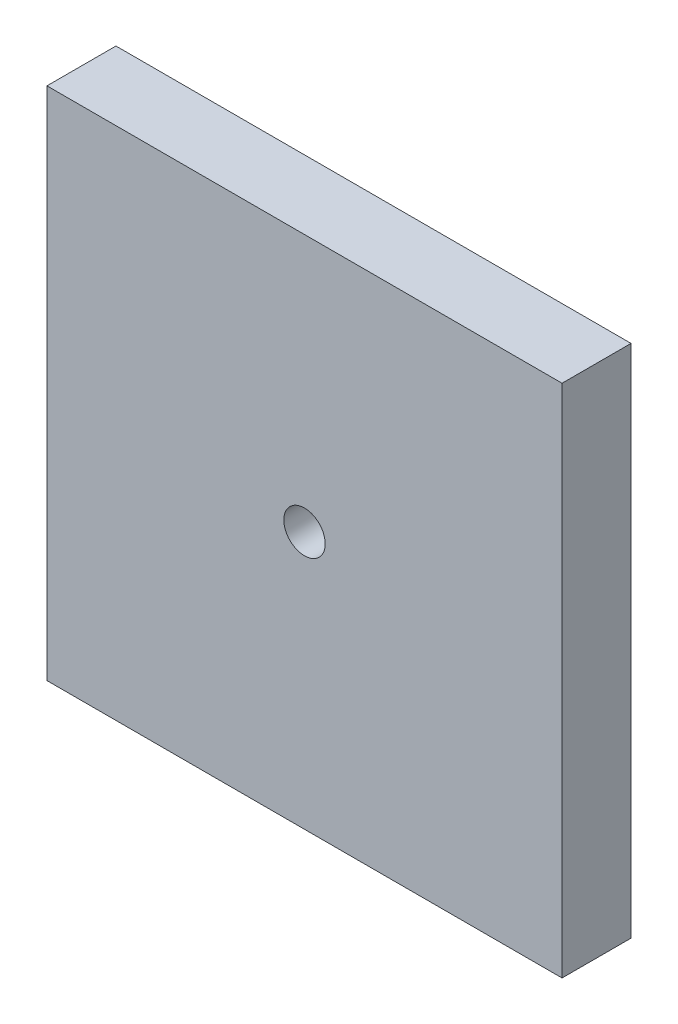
ISO-10303-21;
HEADER;
FILE_DESCRIPTION(('STEP AP214'),'2;1');
FILE_NAME('part.step','',(''),(''),'','','');
FILE_SCHEMA(('AUTOMOTIVE_DESIGN { 1 0 10303 214 1 1 1 1 }'));
ENDSEC;
DATA;
#1=APPLICATION_CONTEXT('core data for automotive mechanical design processes');
#2=APPLICATION_PROTOCOL_DEFINITION('international standard','automotive_design',2000,#1);
#3=PRODUCT_CONTEXT('',#1,'mechanical');
#4=PRODUCT('Part','Part','',(#3));
#5=PRODUCT_RELATED_PRODUCT_CATEGORY('part','',(#4));
#6=PRODUCT_DEFINITION_FORMATION('','',#4);
#7=PRODUCT_DEFINITION_CONTEXT('part definition',#1,'design');
#8=PRODUCT_DEFINITION('design','',#6,#7);
#9=PRODUCT_DEFINITION_SHAPE('','',#8);
#10=(LENGTH_UNIT() NAMED_UNIT(*) SI_UNIT(.MILLI.,.METRE.));
#11=(NAMED_UNIT(*) PLANE_ANGLE_UNIT() SI_UNIT($,.RADIAN.));
#12=(NAMED_UNIT(*) SI_UNIT($,.STERADIAN.) SOLID_ANGLE_UNIT());
#13=UNCERTAINTY_MEASURE_WITH_UNIT(LENGTH_MEASURE(1.E-05),#10,'distance_accuracy_value','');
#14=(GEOMETRIC_REPRESENTATION_CONTEXT(3) GLOBAL_UNCERTAINTY_ASSIGNED_CONTEXT((#13)) GLOBAL_UNIT_ASSIGNED_CONTEXT((#10,
#11,#12)) REPRESENTATION_CONTEXT('',''));
#15=CARTESIAN_POINT('',(0.,0.,0.));
#16=DIRECTION('',(0.,0.,1.));
#17=DIRECTION('',(1.,0.,0.));
#18=AXIS2_PLACEMENT_3D('',#15,#16,#17);
#19=CARTESIAN_POINT('',(44.45,-44.45,11.90625));
#20=DIRECTION('',(-1.,0.,0.));
#21=DIRECTION('',(0.,0.,1.));
#22=AXIS2_PLACEMENT_3D('',#19,#20,#21);
#23=PLANE('',#22);
#24=DIRECTION('',(0.,1.,0.));
#25=VECTOR('',#24,1.);
#26=CARTESIAN_POINT('',(44.45,-44.45,0.));
#27=LINE('',#26,#25);
#28=CARTESIAN_POINT('',(44.45,-44.45,0.));
#29=VERTEX_POINT('',#28);
#30=CARTESIAN_POINT('',(44.45,44.45,0.));
#31=VERTEX_POINT('',#30);
#32=EDGE_CURVE('E96',#29,#31,#27,.T.);
#33=ORIENTED_EDGE('',*,*,#32,.T.);
#34=DIRECTION('',(0.,0.,-1.));
#35=VECTOR('',#34,1.);
#36=CARTESIAN_POINT('',(44.45,44.45,11.90625));
#37=LINE('',#36,#35);
#38=CARTESIAN_POINT('',(44.45,44.45,11.90625));
#39=VERTEX_POINT('',#38);
#40=EDGE_CURVE('E11',#39,#31,#37,.T.);
#41=ORIENTED_EDGE('',*,*,#40,.F.);
#42=DIRECTION('',(0.,1.,0.));
#43=VECTOR('',#42,1.);
#44=CARTESIAN_POINT('',(44.45,-44.45,11.90625));
#45=LINE('',#44,#43);
#46=CARTESIAN_POINT('',(44.45,-44.45,11.90625));
#47=VERTEX_POINT('',#46);
#48=EDGE_CURVE('E84',#47,#39,#45,.T.);
#49=ORIENTED_EDGE('',*,*,#48,.F.);
#50=DIRECTION('',(0.,0.,-1.));
#51=VECTOR('',#50,1.);
#52=CARTESIAN_POINT('',(44.45,-44.45,11.90625));
#53=LINE('',#52,#51);
#54=EDGE_CURVE('E92',#47,#29,#53,.T.);
#55=ORIENTED_EDGE('',*,*,#54,.T.);
#56=EDGE_LOOP('',(#33,#41,#49,#55));
#57=FACE_BOUND('',#56,.T.);
#58=ADVANCED_FACE('F33',(#57),#23,.F.);
#59=CARTESIAN_POINT('',(-44.45,44.45,11.90625));
#60=DIRECTION('',(0.,-1.,0.));
#61=DIRECTION('',(0.,0.,-1.));
#62=AXIS2_PLACEMENT_3D('',#59,#60,#61);
#63=PLANE('',#62);
#64=DIRECTION('',(-1.,0.,0.));
#65=VECTOR('',#64,1.);
#66=CARTESIAN_POINT('',(-44.45,44.45,0.));
#67=LINE('',#66,#65);
#68=CARTESIAN_POINT('',(-44.45,44.45,0.));
#69=VERTEX_POINT('',#68);
#70=EDGE_CURVE('E88',#31,#69,#67,.T.);
#71=ORIENTED_EDGE('',*,*,#70,.T.);
#72=DIRECTION('',(0.,0.,-1.));
#73=VECTOR('',#72,1.);
#74=CARTESIAN_POINT('',(-44.45,44.45,11.90625));
#75=LINE('',#74,#73);
#76=CARTESIAN_POINT('',(-44.45,44.45,11.90625));
#77=VERTEX_POINT('',#76);
#78=EDGE_CURVE('E41',#77,#69,#75,.T.);
#79=ORIENTED_EDGE('',*,*,#78,.F.);
#80=DIRECTION('',(-1.,0.,0.));
#81=VECTOR('',#80,1.);
#82=CARTESIAN_POINT('',(-44.45,44.45,11.90625));
#83=LINE('',#82,#81);
#84=EDGE_CURVE('E79',#39,#77,#83,.T.);
#85=ORIENTED_EDGE('',*,*,#84,.F.);
#86=ORIENTED_EDGE('',*,*,#40,.T.);
#87=EDGE_LOOP('',(#71,#79,#85,#86));
#88=FACE_BOUND('',#87,.T.);
#89=ADVANCED_FACE('F87',(#88),#63,.F.);
#90=CARTESIAN_POINT('',(-44.45,-44.45,11.90625));
#91=DIRECTION('',(1.,0.,0.));
#92=DIRECTION('',(0.,0.,-1.));
#93=AXIS2_PLACEMENT_3D('',#90,#91,#92);
#94=PLANE('',#93);
#95=DIRECTION('',(0.,-1.,0.));
#96=VECTOR('',#95,1.);
#97=CARTESIAN_POINT('',(-44.45,-44.45,0.));
#98=LINE('',#97,#96);
#99=CARTESIAN_POINT('',(-44.45,-44.45,0.));
#100=VERTEX_POINT('',#99);
#101=EDGE_CURVE('E66',#69,#100,#98,.T.);
#102=ORIENTED_EDGE('',*,*,#101,.T.);
#103=DIRECTION('',(0.,0.,-1.));
#104=VECTOR('',#103,1.);
#105=CARTESIAN_POINT('',(-44.45,-44.45,11.90625));
#106=LINE('',#105,#104);
#107=CARTESIAN_POINT('',(-44.45,-44.45,11.90625));
#108=VERTEX_POINT('',#107);
#109=EDGE_CURVE('E89',#108,#100,#106,.T.);
#110=ORIENTED_EDGE('',*,*,#109,.F.);
#111=DIRECTION('',(0.,-1.,0.));
#112=VECTOR('',#111,1.);
#113=CARTESIAN_POINT('',(-44.45,-44.45,11.90625));
#114=LINE('',#113,#112);
#115=EDGE_CURVE('E82',#77,#108,#114,.T.);
#116=ORIENTED_EDGE('',*,*,#115,.F.);
#117=ORIENTED_EDGE('',*,*,#78,.T.);
#118=EDGE_LOOP('',(#102,#110,#116,#117));
#119=FACE_BOUND('',#118,.T.);
#120=ADVANCED_FACE('F90',(#119),#94,.F.);
#121=CARTESIAN_POINT('',(-44.45,-44.45,11.90625));
#122=DIRECTION('',(0.,1.,0.));
#123=DIRECTION('',(0.,0.,1.));
#124=AXIS2_PLACEMENT_3D('',#121,#122,#123);
#125=PLANE('',#124);
#126=DIRECTION('',(1.,0.,0.));
#127=VECTOR('',#126,1.);
#128=CARTESIAN_POINT('',(-44.45,-44.45,0.));
#129=LINE('',#128,#127);
#130=EDGE_CURVE('E72',#100,#29,#129,.T.);
#131=ORIENTED_EDGE('',*,*,#130,.T.);
#132=ORIENTED_EDGE('',*,*,#54,.F.);
#133=DIRECTION('',(1.,0.,0.));
#134=VECTOR('',#133,1.);
#135=CARTESIAN_POINT('',(-44.45,-44.45,11.90625));
#136=LINE('',#135,#134);
#137=EDGE_CURVE('E49',#108,#47,#136,.T.);
#138=ORIENTED_EDGE('',*,*,#137,.F.);
#139=ORIENTED_EDGE('',*,*,#109,.T.);
#140=EDGE_LOOP('',(#131,#132,#138,#139));
#141=FACE_BOUND('',#140,.T.);
#142=ADVANCED_FACE('F104',(#141),#125,.F.);
#143=CARTESIAN_POINT('',(0.,0.,11.90625));
#144=DIRECTION('',(0.,0.,-1.));
#145=DIRECTION('',(-1.,0.,0.));
#146=AXIS2_PLACEMENT_3D('',#143,#144,#145);
#147=PLANE('',#146);
#148=CARTESIAN_POINT('',(0.,0.,11.90625));
#149=DIRECTION('',(0.,0.,1.));
#150=DIRECTION('',(1.,0.,0.));
#151=AXIS2_PLACEMENT_3D('',#148,#149,#150);
#152=CIRCLE('',#151,3.571875);
#153=CARTESIAN_POINT('',(3.571875,0.,11.90625));
#154=VERTEX_POINT('',#153);
#155=EDGE_CURVE('E112',#154,#154,#152,.T.);
#156=ORIENTED_EDGE('',*,*,#155,.F.);
#157=EDGE_LOOP('',(#156));
#158=FACE_BOUND('',#157,.T.);
#159=ORIENTED_EDGE('',*,*,#48,.T.);
#160=ORIENTED_EDGE('',*,*,#84,.T.);
#161=ORIENTED_EDGE('',*,*,#115,.T.);
#162=ORIENTED_EDGE('',*,*,#137,.T.);
#163=EDGE_LOOP('',(#159,#160,#161,#162));
#164=FACE_BOUND('',#163,.T.);
#165=ADVANCED_FACE('F80',(#158,#164),#147,.F.);
#166=CARTESIAN_POINT('',(0.,0.,0.));
#167=DIRECTION('',(0.,0.,-1.));
#168=DIRECTION('',(-1.,0.,0.));
#169=AXIS2_PLACEMENT_3D('',#166,#167,#168);
#170=PLANE('',#169);
#171=CARTESIAN_POINT('',(0.,0.,0.));
#172=DIRECTION('',(0.,0.,1.));
#173=DIRECTION('',(1.,0.,0.));
#174=AXIS2_PLACEMENT_3D('',#171,#172,#173);
#175=CIRCLE('',#174,3.571875);
#176=CARTESIAN_POINT('',(3.571875,0.,0.));
#177=VERTEX_POINT('',#176);
#178=EDGE_CURVE('E99',#177,#177,#175,.T.);
#179=ORIENTED_EDGE('',*,*,#178,.T.);
#180=EDGE_LOOP('',(#179));
#181=FACE_BOUND('',#180,.T.);
#182=ORIENTED_EDGE('',*,*,#32,.F.);
#183=ORIENTED_EDGE('',*,*,#130,.F.);
#184=ORIENTED_EDGE('',*,*,#101,.F.);
#185=ORIENTED_EDGE('',*,*,#70,.F.);
#186=EDGE_LOOP('',(#182,#183,#184,#185));
#187=FACE_BOUND('',#186,.T.);
#188=ADVANCED_FACE('F107',(#181,#187),#170,.T.);
#189=CARTESIAN_POINT('',(0.,0.,11.90625));
#190=DIRECTION('',(0.,0.,1.));
#191=DIRECTION('',(1.,0.,0.));
#192=AXIS2_PLACEMENT_3D('',#189,#190,#191);
#193=CYLINDRICAL_SURFACE('',#192,3.571875);
#194=ORIENTED_EDGE('',*,*,#178,.F.);
#195=EDGE_LOOP('',(#194));
#196=FACE_BOUND('',#195,.T.);
#197=ORIENTED_EDGE('',*,*,#155,.T.);
#198=EDGE_LOOP('',(#197));
#199=FACE_BOUND('',#198,.T.);
#200=ADVANCED_FACE('F116',(#196,#199),#193,.F.);
#201=CLOSED_SHELL('',(#58,#89,#120,#142,#165,#188,#200));
#202=MANIFOLD_SOLID_BREP('B2',#201);
#203=ADVANCED_BREP_SHAPE_REPRESENTATION('',(#18,#202),#14);
#204=SHAPE_DEFINITION_REPRESENTATION(#9,#203);
ENDSEC;
END-ISO-10303-21;
